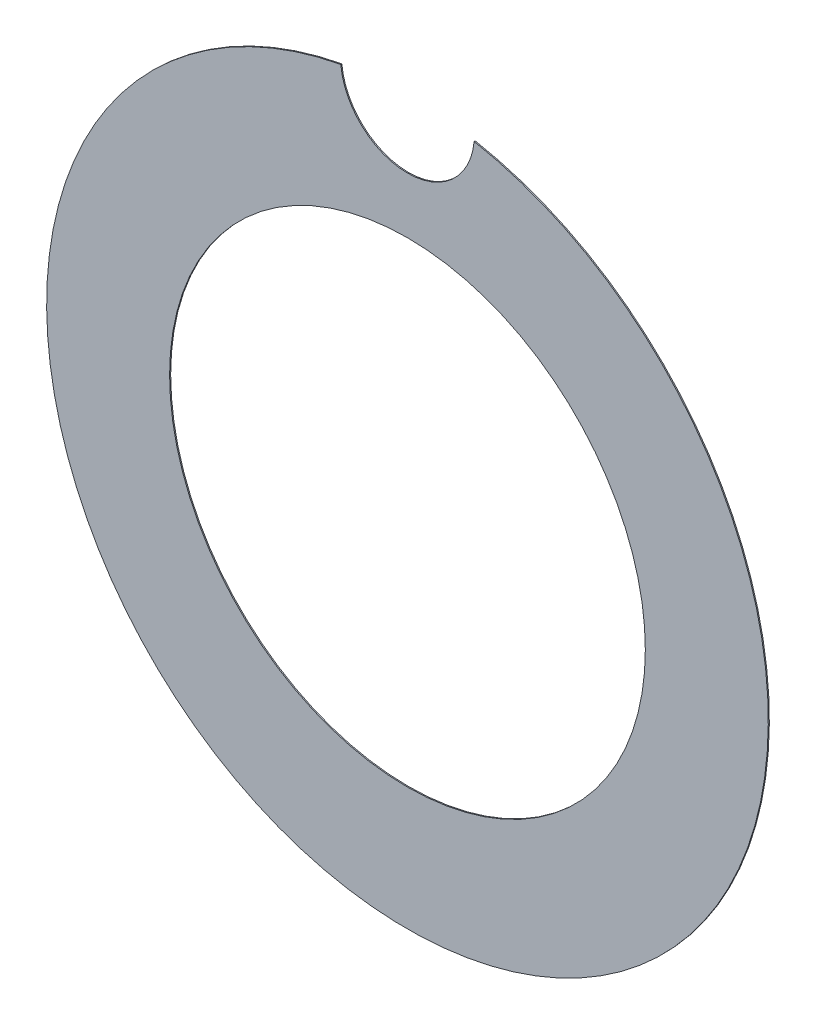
ISO-10303-21;
HEADER;
FILE_DESCRIPTION(('STEP AP214'),'2;1');
FILE_NAME('part.step','',(''),(''),'','','');
FILE_SCHEMA(('AUTOMOTIVE_DESIGN { 1 0 10303 214 1 1 1 1 }'));
ENDSEC;
DATA;
#1=APPLICATION_CONTEXT('core data for automotive mechanical design processes');
#2=APPLICATION_PROTOCOL_DEFINITION('international standard','automotive_design',2000,#1);
#3=PRODUCT_CONTEXT('',#1,'mechanical');
#4=PRODUCT('Part','Part','',(#3));
#5=PRODUCT_RELATED_PRODUCT_CATEGORY('part','',(#4));
#6=PRODUCT_DEFINITION_FORMATION('','',#4);
#7=PRODUCT_DEFINITION_CONTEXT('part definition',#1,'design');
#8=PRODUCT_DEFINITION('design','',#6,#7);
#9=PRODUCT_DEFINITION_SHAPE('','',#8);
#10=(LENGTH_UNIT() NAMED_UNIT(*) SI_UNIT(.MILLI.,.METRE.));
#11=(NAMED_UNIT(*) PLANE_ANGLE_UNIT() SI_UNIT($,.RADIAN.));
#12=(NAMED_UNIT(*) SI_UNIT($,.STERADIAN.) SOLID_ANGLE_UNIT());
#13=UNCERTAINTY_MEASURE_WITH_UNIT(LENGTH_MEASURE(1.E-05),#10,'distance_accuracy_value','');
#14=(GEOMETRIC_REPRESENTATION_CONTEXT(3) GLOBAL_UNCERTAINTY_ASSIGNED_CONTEXT((#13)) GLOBAL_UNIT_ASSIGNED_CONTEXT((#10,
#11,#12)) REPRESENTATION_CONTEXT('',''));
#15=CARTESIAN_POINT('',(0.,0.,0.));
#16=DIRECTION('',(0.,0.,1.));
#17=DIRECTION('',(1.,0.,0.));
#18=AXIS2_PLACEMENT_3D('',#15,#16,#17);
#19=CARTESIAN_POINT('',(0.,0.,0.0508));
#20=DIRECTION('',(0.,0.,1.));
#21=DIRECTION('',(1.,0.,0.));
#22=AXIS2_PLACEMENT_3D('',#19,#20,#21);
#23=PLANE('',#22);
#24=CARTESIAN_POINT('',(0.,0.,0.0508));
#25=DIRECTION('',(0.,0.,1.));
#26=DIRECTION('',(1.,0.,0.));
#27=AXIS2_PLACEMENT_3D('',#24,#25,#26);
#28=CIRCLE('',#27,11.2776);
#29=CARTESIAN_POINT('',(11.2776,0.,0.0508));
#30=VERTEX_POINT('',#29);
#31=EDGE_CURVE('E70',#30,#30,#28,.T.);
#32=ORIENTED_EDGE('',*,*,#31,.F.);
#33=EDGE_LOOP('',(#32));
#34=FACE_BOUND('',#33,.T.);
#35=CARTESIAN_POINT('',(0.,0.,0.0508));
#36=DIRECTION('',(0.,0.,1.));
#37=DIRECTION('',(1.,0.,0.));
#38=AXIS2_PLACEMENT_3D('',#35,#36,#37);
#39=CIRCLE('',#38,17.1069);
#40=CARTESIAN_POINT('',(-3.1612994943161,16.8122637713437,0.0508));
#41=VERTEX_POINT('',#40);
#42=CARTESIAN_POINT('',(3.1612994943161,16.8122637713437,0.0508));
#43=VERTEX_POINT('',#42);
#44=EDGE_CURVE('E11',#41,#43,#39,.T.);
#45=ORIENTED_EDGE('',*,*,#44,.T.);
#46=CARTESIAN_POINT('',(0.,17.1069,0.0508));
#47=DIRECTION('',(0.,0.,1.));
#48=DIRECTION('',(1.,0.,0.));
#49=AXIS2_PLACEMENT_3D('',#46,#47,#48);
#50=CIRCLE('',#49,3.175);
#51=EDGE_CURVE('E54',#41,#43,#50,.T.);
#52=ORIENTED_EDGE('',*,*,#51,.F.);
#53=EDGE_LOOP('',(#45,#52));
#54=FACE_BOUND('',#53,.T.);
#55=ADVANCED_FACE('F33',(#34,#54),#23,.T.);
#56=CARTESIAN_POINT('',(0.,0.,0.));
#57=DIRECTION('',(0.,0.,1.));
#58=DIRECTION('',(1.,0.,0.));
#59=AXIS2_PLACEMENT_3D('',#56,#57,#58);
#60=PLANE('',#59);
#61=CARTESIAN_POINT('',(0.,0.,0.));
#62=DIRECTION('',(0.,0.,1.));
#63=DIRECTION('',(1.,0.,0.));
#64=AXIS2_PLACEMENT_3D('',#61,#62,#63);
#65=CIRCLE('',#64,11.2776);
#66=CARTESIAN_POINT('',(11.2776,0.,0.));
#67=VERTEX_POINT('',#66);
#68=EDGE_CURVE('E63',#67,#67,#65,.T.);
#69=ORIENTED_EDGE('',*,*,#68,.T.);
#70=EDGE_LOOP('',(#69));
#71=FACE_BOUND('',#70,.T.);
#72=CARTESIAN_POINT('',(0.,17.1069,0.));
#73=DIRECTION('',(0.,0.,1.));
#74=DIRECTION('',(-1.,0.,0.));
#75=AXIS2_PLACEMENT_3D('',#72,#73,#74);
#76=CIRCLE('',#75,3.175);
#77=CARTESIAN_POINT('',(-3.1612994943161,16.8122637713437,0.));
#78=VERTEX_POINT('',#77);
#79=CARTESIAN_POINT('',(3.1612994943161,16.8122637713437,0.));
#80=VERTEX_POINT('',#79);
#81=EDGE_CURVE('E48',#78,#80,#76,.T.);
#82=ORIENTED_EDGE('',*,*,#81,.T.);
#83=CARTESIAN_POINT('',(0.,0.,0.));
#84=DIRECTION('',(0.,0.,1.));
#85=DIRECTION('',(1.,0.,0.));
#86=AXIS2_PLACEMENT_3D('',#83,#84,#85);
#87=CIRCLE('',#86,17.1069);
#88=EDGE_CURVE('E41',#78,#80,#87,.T.);
#89=ORIENTED_EDGE('',*,*,#88,.F.);
#90=EDGE_LOOP('',(#82,#89));
#91=FACE_BOUND('',#90,.T.);
#92=ADVANCED_FACE('F68',(#71,#91),#60,.F.);
#93=CARTESIAN_POINT('',(0.,0.,0.0508));
#94=DIRECTION('',(0.,0.,-1.));
#95=DIRECTION('',(-1.,0.,0.));
#96=AXIS2_PLACEMENT_3D('',#93,#94,#95);
#97=CYLINDRICAL_SURFACE('',#96,17.1069);
#98=DIRECTION('',(0.,0.,-1.));
#99=VECTOR('',#98,1.);
#100=CARTESIAN_POINT('',(3.1612994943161,16.8122637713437,0.));
#101=LINE('',#100,#99);
#102=EDGE_CURVE('E58',#80,#43,#101,.F.);
#103=ORIENTED_EDGE('',*,*,#102,.T.);
#104=ORIENTED_EDGE('',*,*,#44,.F.);
#105=DIRECTION('',(0.,0.,-1.));
#106=VECTOR('',#105,1.);
#107=CARTESIAN_POINT('',(-3.1612994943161,16.8122637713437,0.));
#108=LINE('',#107,#106);
#109=EDGE_CURVE('E64',#78,#41,#108,.F.);
#110=ORIENTED_EDGE('',*,*,#109,.F.);
#111=ORIENTED_EDGE('',*,*,#88,.T.);
#112=EDGE_LOOP('',(#103,#104,#110,#111));
#113=FACE_BOUND('',#112,.T.);
#114=ADVANCED_FACE('F35',(#113),#97,.T.);
#115=CARTESIAN_POINT('',(0.,0.,0.0508));
#116=DIRECTION('',(0.,0.,-1.));
#117=DIRECTION('',(-1.,0.,0.));
#118=AXIS2_PLACEMENT_3D('',#115,#116,#117);
#119=CYLINDRICAL_SURFACE('',#118,11.2776);
#120=ORIENTED_EDGE('',*,*,#31,.T.);
#121=EDGE_LOOP('',(#120));
#122=FACE_BOUND('',#121,.T.);
#123=ORIENTED_EDGE('',*,*,#68,.F.);
#124=EDGE_LOOP('',(#123));
#125=FACE_BOUND('',#124,.T.);
#126=ADVANCED_FACE('F87',(#122,#125),#119,.F.);
#127=CARTESIAN_POINT('',(0.,17.1069,0.));
#128=DIRECTION('',(0.,0.,1.));
#129=DIRECTION('',(1.,0.,0.));
#130=AXIS2_PLACEMENT_3D('',#127,#128,#129);
#131=CYLINDRICAL_SURFACE('',#130,3.175);
#132=ORIENTED_EDGE('',*,*,#102,.F.);
#133=ORIENTED_EDGE('',*,*,#81,.F.);
#134=ORIENTED_EDGE('',*,*,#109,.T.);
#135=ORIENTED_EDGE('',*,*,#51,.T.);
#136=EDGE_LOOP('',(#132,#133,#134,#135));
#137=FACE_BOUND('',#136,.T.);
#138=ADVANCED_FACE('F59',(#137),#131,.F.);
#139=CLOSED_SHELL('',(#55,#92,#114,#126,#138));
#140=MANIFOLD_SOLID_BREP('B2',#139);
#141=ADVANCED_BREP_SHAPE_REPRESENTATION('',(#18,#140),#14);
#142=SHAPE_DEFINITION_REPRESENTATION(#9,#141);
ENDSEC;
END-ISO-10303-21;
